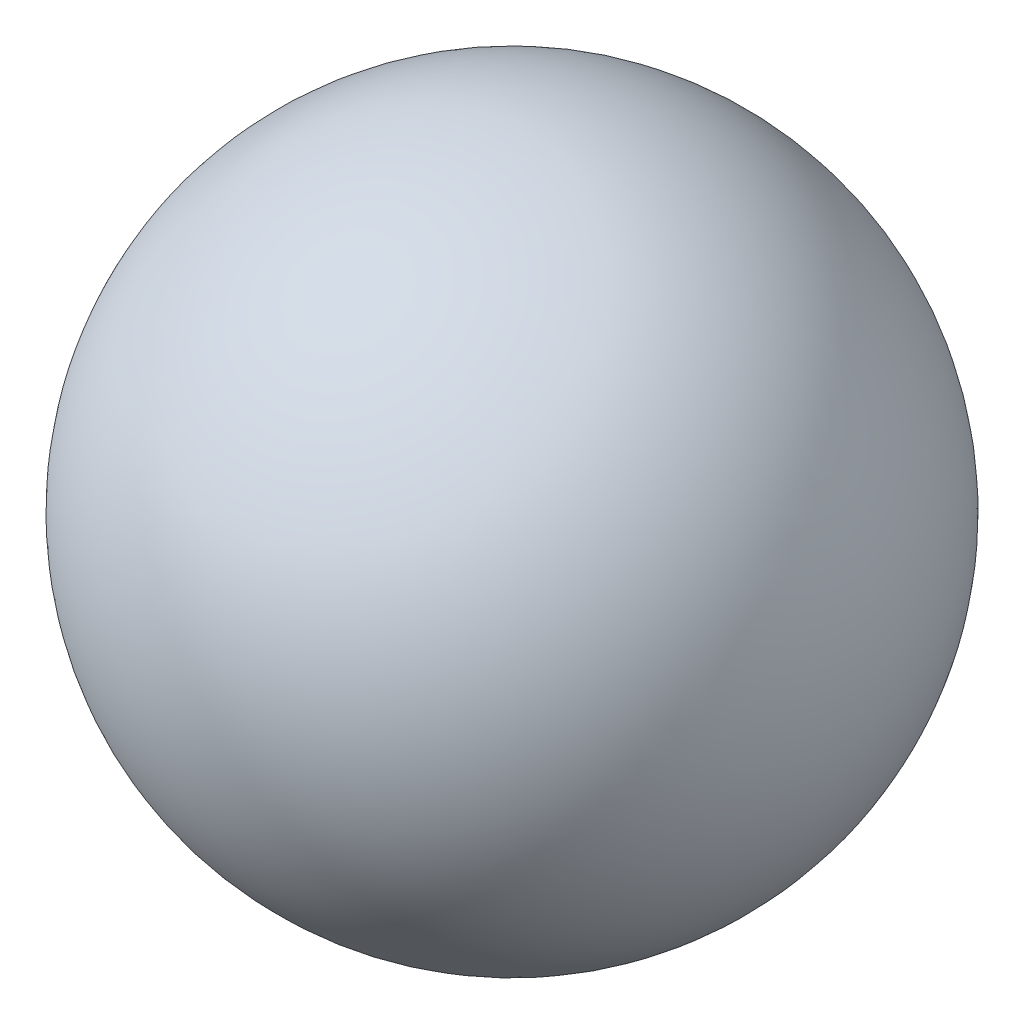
from build123d import *


with BuildPart() as part:
    # Esquisse1 → Base-R_volution (revolve)
    with BuildSketch(Plane(origin=(0, 0, 0), x_dir=(1, 0, 0), z_dir=(0, 1, 0))):
        with BuildLine():
            Line((2.45, 5.75), (10.55, 5.75))
            ThreePointArc((10.55, 5.75), (6.5, 9.8), (2.45, 5.75))
        make_face()
    revolve(axis=Axis((-1, 0, -5.75), (1, 0, 0)))


solid = part.part
